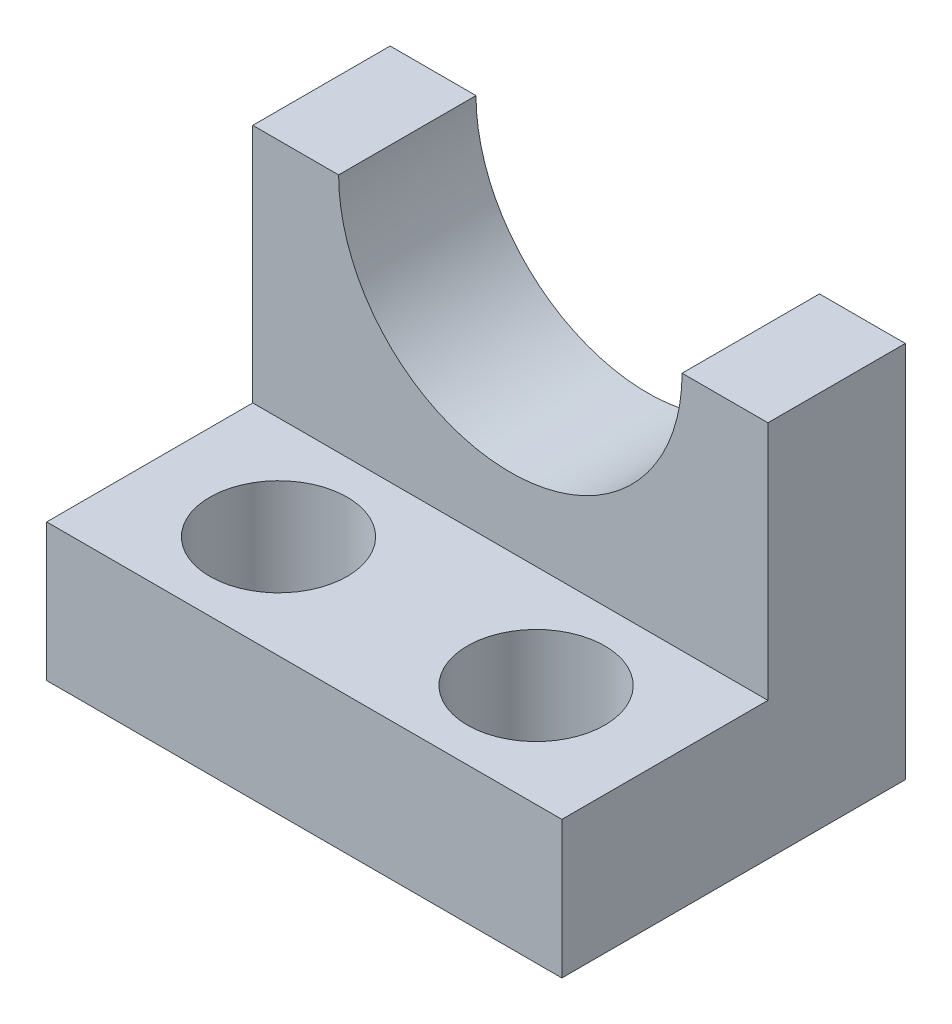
ISO-10303-21;
HEADER;
FILE_DESCRIPTION(('STEP AP214'),'2;1');
FILE_NAME('part.step','',(''),(''),'','','');
FILE_SCHEMA(('AUTOMOTIVE_DESIGN { 1 0 10303 214 1 1 1 1 }'));
ENDSEC;
DATA;
#1=APPLICATION_CONTEXT('core data for automotive mechanical design processes');
#2=APPLICATION_PROTOCOL_DEFINITION('international standard','automotive_design',2000,#1);
#3=PRODUCT_CONTEXT('',#1,'mechanical');
#4=PRODUCT('Part','Part','',(#3));
#5=PRODUCT_RELATED_PRODUCT_CATEGORY('part','',(#4));
#6=PRODUCT_DEFINITION_FORMATION('','',#4);
#7=PRODUCT_DEFINITION_CONTEXT('part definition',#1,'design');
#8=PRODUCT_DEFINITION('design','',#6,#7);
#9=PRODUCT_DEFINITION_SHAPE('','',#8);
#10=(LENGTH_UNIT() NAMED_UNIT(*) SI_UNIT(.MILLI.,.METRE.));
#11=(NAMED_UNIT(*) PLANE_ANGLE_UNIT() SI_UNIT($,.RADIAN.));
#12=(NAMED_UNIT(*) SI_UNIT($,.STERADIAN.) SOLID_ANGLE_UNIT());
#13=UNCERTAINTY_MEASURE_WITH_UNIT(LENGTH_MEASURE(1.E-05),#10,'distance_accuracy_value','');
#14=(GEOMETRIC_REPRESENTATION_CONTEXT(3) GLOBAL_UNCERTAINTY_ASSIGNED_CONTEXT((#13)) GLOBAL_UNIT_ASSIGNED_CONTEXT((#10,
#11,#12)) REPRESENTATION_CONTEXT('',''));
#15=CARTESIAN_POINT('',(0.,0.,0.));
#16=DIRECTION('',(0.,0.,1.));
#17=DIRECTION('',(1.,0.,0.));
#18=AXIS2_PLACEMENT_3D('',#15,#16,#17);
#19=CARTESIAN_POINT('',(0.,22.,-12.));
#20=DIRECTION('',(0.,1.,0.));
#21=DIRECTION('',(0.,0.,1.));
#22=AXIS2_PLACEMENT_3D('',#19,#20,#21);
#23=PLANE('',#22);
#24=DIRECTION('',(0.,0.,1.));
#25=VECTOR('',#24,1.);
#26=CARTESIAN_POINT('',(5.,22.,-20.));
#27=LINE('',#26,#25);
#28=CARTESIAN_POINT('',(5.,22.,-20.));
#29=VERTEX_POINT('',#28);
#30=CARTESIAN_POINT('',(5.,22.,-12.));
#31=VERTEX_POINT('',#30);
#32=EDGE_CURVE('E11',#29,#31,#27,.T.);
#33=ORIENTED_EDGE('',*,*,#32,.F.);
#34=DIRECTION('',(-1.,0.,0.));
#35=VECTOR('',#34,1.);
#36=CARTESIAN_POINT('',(0.,22.,-20.));
#37=LINE('',#36,#35);
#38=CARTESIAN_POINT('',(0.,22.,-20.));
#39=VERTEX_POINT('',#38);
#40=EDGE_CURVE('E114',#29,#39,#37,.T.);
#41=ORIENTED_EDGE('',*,*,#40,.T.);
#42=DIRECTION('',(0.,0.,1.));
#43=VECTOR('',#42,1.);
#44=CARTESIAN_POINT('',(0.,22.,-20.));
#45=LINE('',#44,#43);
#46=CARTESIAN_POINT('',(0.,22.,-12.));
#47=VERTEX_POINT('',#46);
#48=EDGE_CURVE('E109',#39,#47,#45,.T.);
#49=ORIENTED_EDGE('',*,*,#48,.T.);
#50=DIRECTION('',(1.,0.,0.));
#51=VECTOR('',#50,1.);
#52=CARTESIAN_POINT('',(0.,22.,-12.));
#53=LINE('',#52,#51);
#54=EDGE_CURVE('E103',#47,#31,#53,.T.);
#55=ORIENTED_EDGE('',*,*,#54,.T.);
#56=EDGE_LOOP('',(#33,#41,#49,#55));
#57=FACE_BOUND('',#56,.T.);
#58=ADVANCED_FACE('F31',(#57),#23,.T.);
#59=CARTESIAN_POINT('',(0.,8.,-20.));
#60=DIRECTION('',(0.,-1.,0.));
#61=DIRECTION('',(0.,0.,-1.));
#62=AXIS2_PLACEMENT_3D('',#59,#60,#61);
#63=PLANE('',#62);
#64=CARTESIAN_POINT('',(22.5,8.,-6.));
#65=DIRECTION('',(0.,1.,0.));
#66=DIRECTION('',(0.,0.,1.));
#67=AXIS2_PLACEMENT_3D('',#64,#65,#66);
#68=CIRCLE('',#67,4.);
#69=CARTESIAN_POINT('',(22.5,8.,-2.));
#70=VERTEX_POINT('',#69);
#71=EDGE_CURVE('E185',#70,#70,#68,.T.);
#72=ORIENTED_EDGE('',*,*,#71,.F.);
#73=EDGE_LOOP('',(#72));
#74=FACE_BOUND('',#73,.T.);
#75=CARTESIAN_POINT('',(7.5,8.,-6.));
#76=DIRECTION('',(0.,1.,0.));
#77=DIRECTION('',(0.,0.,1.));
#78=AXIS2_PLACEMENT_3D('',#75,#76,#77);
#79=CIRCLE('',#78,4.);
#80=CARTESIAN_POINT('',(7.5,8.,-2.));
#81=VERTEX_POINT('',#80);
#82=EDGE_CURVE('E280',#81,#81,#79,.T.);
#83=ORIENTED_EDGE('',*,*,#82,.F.);
#84=EDGE_LOOP('',(#83));
#85=FACE_BOUND('',#84,.T.);
#86=DIRECTION('',(1.,0.,0.));
#87=VECTOR('',#86,1.);
#88=CARTESIAN_POINT('',(0.,8.,-12.));
#89=LINE('',#88,#87);
#90=CARTESIAN_POINT('',(0.,8.,-12.));
#91=VERTEX_POINT('',#90);
#92=CARTESIAN_POINT('',(30.,8.,-12.));
#93=VERTEX_POINT('',#92);
#94=EDGE_CURVE('E53',#91,#93,#89,.T.);
#95=ORIENTED_EDGE('',*,*,#94,.F.);
#96=DIRECTION('',(0.,0.,1.));
#97=VECTOR('',#96,1.);
#98=CARTESIAN_POINT('',(0.,8.,0.));
#99=LINE('',#98,#97);
#100=CARTESIAN_POINT('',(0.,8.,0.));
#101=VERTEX_POINT('',#100);
#102=EDGE_CURVE('E154',#91,#101,#99,.T.);
#103=ORIENTED_EDGE('',*,*,#102,.T.);
#104=DIRECTION('',(1.,0.,0.));
#105=VECTOR('',#104,1.);
#106=CARTESIAN_POINT('',(0.,8.,0.));
#107=LINE('',#106,#105);
#108=CARTESIAN_POINT('',(30.,8.,0.));
#109=VERTEX_POINT('',#108);
#110=EDGE_CURVE('E155',#101,#109,#107,.T.);
#111=ORIENTED_EDGE('',*,*,#110,.T.);
#112=DIRECTION('',(0.,0.,-1.));
#113=VECTOR('',#112,1.);
#114=CARTESIAN_POINT('',(30.,8.,0.));
#115=LINE('',#114,#113);
#116=EDGE_CURVE('E131',#109,#93,#115,.T.);
#117=ORIENTED_EDGE('',*,*,#116,.T.);
#118=EDGE_LOOP('',(#95,#103,#111,#117));
#119=FACE_BOUND('',#118,.T.);
#120=ADVANCED_FACE('F184',(#74,#85,#119),#63,.F.);
#121=CARTESIAN_POINT('',(0.,8.,0.));
#122=DIRECTION('',(1.,0.,0.));
#123=DIRECTION('',(0.,0.,-1.));
#124=AXIS2_PLACEMENT_3D('',#121,#122,#123);
#125=PLANE('',#124);
#126=DIRECTION('',(0.,0.,1.));
#127=VECTOR('',#126,1.);
#128=CARTESIAN_POINT('',(0.,0.,0.));
#129=LINE('',#128,#127);
#130=CARTESIAN_POINT('',(0.,0.,-20.));
#131=VERTEX_POINT('',#130);
#132=CARTESIAN_POINT('',(0.,0.,0.));
#133=VERTEX_POINT('',#132);
#134=EDGE_CURVE('E140',#131,#133,#129,.T.);
#135=ORIENTED_EDGE('',*,*,#134,.T.);
#136=DIRECTION('',(0.,-1.,0.));
#137=VECTOR('',#136,1.);
#138=CARTESIAN_POINT('',(0.,8.,0.));
#139=LINE('',#138,#137);
#140=EDGE_CURVE('E142',#101,#133,#139,.T.);
#141=ORIENTED_EDGE('',*,*,#140,.F.);
#142=ORIENTED_EDGE('',*,*,#102,.F.);
#143=DIRECTION('',(0.,-1.,0.));
#144=VECTOR('',#143,1.);
#145=CARTESIAN_POINT('',(0.,22.,-12.));
#146=LINE('',#145,#144);
#147=EDGE_CURVE('E136',#47,#91,#146,.T.);
#148=ORIENTED_EDGE('',*,*,#147,.F.);
#149=ORIENTED_EDGE('',*,*,#48,.F.);
#150=DIRECTION('',(0.,-1.,0.));
#151=VECTOR('',#150,1.);
#152=CARTESIAN_POINT('',(0.,8.,-20.));
#153=LINE('',#152,#151);
#154=EDGE_CURVE('E168',#39,#131,#153,.T.);
#155=ORIENTED_EDGE('',*,*,#154,.T.);
#156=EDGE_LOOP('',(#135,#141,#142,#148,#149,#155));
#157=FACE_BOUND('',#156,.T.);
#158=ADVANCED_FACE('F33',(#157),#125,.F.);
#159=CARTESIAN_POINT('',(0.,8.,0.));
#160=DIRECTION('',(0.,0.,-1.));
#161=DIRECTION('',(-1.,0.,0.));
#162=AXIS2_PLACEMENT_3D('',#159,#160,#161);
#163=PLANE('',#162);
#164=DIRECTION('',(1.,0.,0.));
#165=VECTOR('',#164,1.);
#166=CARTESIAN_POINT('',(0.,0.,0.));
#167=LINE('',#166,#165);
#168=CARTESIAN_POINT('',(30.,0.,0.));
#169=VERTEX_POINT('',#168);
#170=EDGE_CURVE('E164',#133,#169,#167,.T.);
#171=ORIENTED_EDGE('',*,*,#170,.T.);
#172=DIRECTION('',(0.,-1.,0.));
#173=VECTOR('',#172,1.);
#174=CARTESIAN_POINT('',(30.,8.,0.));
#175=LINE('',#174,#173);
#176=EDGE_CURVE('E144',#109,#169,#175,.T.);
#177=ORIENTED_EDGE('',*,*,#176,.F.);
#178=ORIENTED_EDGE('',*,*,#110,.F.);
#179=ORIENTED_EDGE('',*,*,#140,.T.);
#180=EDGE_LOOP('',(#171,#177,#178,#179));
#181=FACE_BOUND('',#180,.T.);
#182=ADVANCED_FACE('F181',(#181),#163,.F.);
#183=CARTESIAN_POINT('',(30.,8.,0.));
#184=DIRECTION('',(-1.,0.,0.));
#185=DIRECTION('',(0.,0.,1.));
#186=AXIS2_PLACEMENT_3D('',#183,#184,#185);
#187=PLANE('',#186);
#188=DIRECTION('',(0.,0.,-1.));
#189=VECTOR('',#188,1.);
#190=CARTESIAN_POINT('',(30.,0.,0.));
#191=LINE('',#190,#189);
#192=CARTESIAN_POINT('',(30.,0.,-20.));
#193=VERTEX_POINT('',#192);
#194=EDGE_CURVE('E157',#169,#193,#191,.T.);
#195=ORIENTED_EDGE('',*,*,#194,.T.);
#196=DIRECTION('',(0.,-1.,0.));
#197=VECTOR('',#196,1.);
#198=CARTESIAN_POINT('',(30.,8.,-20.));
#199=LINE('',#198,#197);
#200=CARTESIAN_POINT('',(30.,22.,-20.));
#201=VERTEX_POINT('',#200);
#202=EDGE_CURVE('E151',#201,#193,#199,.T.);
#203=ORIENTED_EDGE('',*,*,#202,.F.);
#204=DIRECTION('',(0.,0.,-1.));
#205=VECTOR('',#204,1.);
#206=CARTESIAN_POINT('',(30.,22.,-20.));
#207=LINE('',#206,#205);
#208=CARTESIAN_POINT('',(30.,22.,-12.));
#209=VERTEX_POINT('',#208);
#210=EDGE_CURVE('E111',#209,#201,#207,.T.);
#211=ORIENTED_EDGE('',*,*,#210,.F.);
#212=DIRECTION('',(0.,-1.,0.));
#213=VECTOR('',#212,1.);
#214=CARTESIAN_POINT('',(30.,22.,-12.));
#215=LINE('',#214,#213);
#216=EDGE_CURVE('E122',#209,#93,#215,.T.);
#217=ORIENTED_EDGE('',*,*,#216,.T.);
#218=ORIENTED_EDGE('',*,*,#116,.F.);
#219=ORIENTED_EDGE('',*,*,#176,.T.);
#220=EDGE_LOOP('',(#195,#203,#211,#217,#218,#219));
#221=FACE_BOUND('',#220,.T.);
#222=ADVANCED_FACE('F183',(#221),#187,.F.);
#223=CARTESIAN_POINT('',(0.,8.,-20.));
#224=DIRECTION('',(0.,0.,1.));
#225=DIRECTION('',(1.,0.,0.));
#226=AXIS2_PLACEMENT_3D('',#223,#224,#225);
#227=PLANE('',#226);
#228=ORIENTED_EDGE('',*,*,#40,.F.);
#229=CARTESIAN_POINT('',(15.,22.,-20.));
#230=DIRECTION('',(0.,0.,1.));
#231=DIRECTION('',(1.,0.,0.));
#232=AXIS2_PLACEMENT_3D('',#229,#230,#231);
#233=CIRCLE('',#232,10.);
#234=CARTESIAN_POINT('',(25.,22.,-20.));
#235=VERTEX_POINT('',#234);
#236=EDGE_CURVE('E95',#29,#235,#233,.T.);
#237=ORIENTED_EDGE('',*,*,#236,.T.);
#238=EDGE_CURVE('E119',#201,#235,#37,.T.);
#239=ORIENTED_EDGE('',*,*,#238,.F.);
#240=ORIENTED_EDGE('',*,*,#202,.T.);
#241=DIRECTION('',(-1.,0.,0.));
#242=VECTOR('',#241,1.);
#243=CARTESIAN_POINT('',(0.,0.,-20.));
#244=LINE('',#243,#242);
#245=EDGE_CURVE('E156',#193,#131,#244,.T.);
#246=ORIENTED_EDGE('',*,*,#245,.T.);
#247=ORIENTED_EDGE('',*,*,#154,.F.);
#248=EDGE_LOOP('',(#228,#237,#239,#240,#246,#247));
#249=FACE_BOUND('',#248,.T.);
#250=ADVANCED_FACE('F170',(#249),#227,.F.);
#251=CARTESIAN_POINT('',(0.,0.,-20.));
#252=DIRECTION('',(0.,-1.,0.));
#253=DIRECTION('',(0.,0.,-1.));
#254=AXIS2_PLACEMENT_3D('',#251,#252,#253);
#255=PLANE('',#254);
#256=CARTESIAN_POINT('',(22.5,0.,-6.));
#257=DIRECTION('',(0.,1.,0.));
#258=DIRECTION('',(0.,0.,1.));
#259=AXIS2_PLACEMENT_3D('',#256,#257,#258);
#260=CIRCLE('',#259,4.);
#261=CARTESIAN_POINT('',(22.5,0.,-2.));
#262=VERTEX_POINT('',#261);
#263=EDGE_CURVE('E277',#262,#262,#260,.T.);
#264=ORIENTED_EDGE('',*,*,#263,.T.);
#265=EDGE_LOOP('',(#264));
#266=FACE_BOUND('',#265,.T.);
#267=CARTESIAN_POINT('',(7.5,0.,-6.));
#268=DIRECTION('',(0.,1.,0.));
#269=DIRECTION('',(0.,0.,1.));
#270=AXIS2_PLACEMENT_3D('',#267,#268,#269);
#271=CIRCLE('',#270,4.);
#272=CARTESIAN_POINT('',(7.5,0.,-2.));
#273=VERTEX_POINT('',#272);
#274=EDGE_CURVE('E130',#273,#273,#271,.T.);
#275=ORIENTED_EDGE('',*,*,#274,.T.);
#276=EDGE_LOOP('',(#275));
#277=FACE_BOUND('',#276,.T.);
#278=ORIENTED_EDGE('',*,*,#134,.F.);
#279=ORIENTED_EDGE('',*,*,#245,.F.);
#280=ORIENTED_EDGE('',*,*,#194,.F.);
#281=ORIENTED_EDGE('',*,*,#170,.F.);
#282=EDGE_LOOP('',(#278,#279,#280,#281));
#283=FACE_BOUND('',#282,.T.);
#284=ADVANCED_FACE('F176',(#266,#277,#283),#255,.T.);
#285=CARTESIAN_POINT('',(0.,22.,-12.));
#286=DIRECTION('',(0.,0.,-1.));
#287=DIRECTION('',(-1.,0.,0.));
#288=AXIS2_PLACEMENT_3D('',#285,#286,#287);
#289=PLANE('',#288);
#290=CARTESIAN_POINT('',(25.,22.,-12.));
#291=VERTEX_POINT('',#290);
#292=EDGE_CURVE('E106',#291,#209,#53,.T.);
#293=ORIENTED_EDGE('',*,*,#292,.F.);
#294=CARTESIAN_POINT('',(15.,22.,-12.));
#295=DIRECTION('',(0.,0.,1.));
#296=DIRECTION('',(1.,0.,0.));
#297=AXIS2_PLACEMENT_3D('',#294,#295,#296);
#298=CIRCLE('',#297,10.);
#299=EDGE_CURVE('E45',#31,#291,#298,.T.);
#300=ORIENTED_EDGE('',*,*,#299,.F.);
#301=ORIENTED_EDGE('',*,*,#54,.F.);
#302=ORIENTED_EDGE('',*,*,#147,.T.);
#303=ORIENTED_EDGE('',*,*,#94,.T.);
#304=ORIENTED_EDGE('',*,*,#216,.F.);
#305=EDGE_LOOP('',(#293,#300,#301,#302,#303,#304));
#306=FACE_BOUND('',#305,.T.);
#307=ADVANCED_FACE('F101',(#306),#289,.F.);
#308=DIRECTION('',(0.,0.,1.));
#309=VECTOR('',#308,1.);
#310=CARTESIAN_POINT('',(25.,22.,-20.));
#311=LINE('',#310,#309);
#312=EDGE_CURVE('E39',#291,#235,#311,.F.);
#313=ORIENTED_EDGE('',*,*,#312,.F.);
#314=ORIENTED_EDGE('',*,*,#292,.T.);
#315=ORIENTED_EDGE('',*,*,#210,.T.);
#316=ORIENTED_EDGE('',*,*,#238,.T.);
#317=EDGE_LOOP('',(#313,#314,#315,#316));
#318=FACE_BOUND('',#317,.T.);
#319=ADVANCED_FACE('F188',(#318),#23,.T.);
#320=CARTESIAN_POINT('',(7.5,0.,-6.));
#321=DIRECTION('',(0.,1.,0.));
#322=DIRECTION('',(0.,0.,1.));
#323=AXIS2_PLACEMENT_3D('',#320,#321,#322);
#324=CYLINDRICAL_SURFACE('',#323,4.);
#325=ORIENTED_EDGE('',*,*,#274,.F.);
#326=EDGE_LOOP('',(#325));
#327=FACE_BOUND('',#326,.T.);
#328=ORIENTED_EDGE('',*,*,#82,.T.);
#329=EDGE_LOOP('',(#328));
#330=FACE_BOUND('',#329,.T.);
#331=ADVANCED_FACE('F190',(#327,#330),#324,.F.);
#332=CARTESIAN_POINT('',(22.5,0.,-6.));
#333=DIRECTION('',(0.,1.,0.));
#334=DIRECTION('',(0.,0.,1.));
#335=AXIS2_PLACEMENT_3D('',#332,#333,#334);
#336=CYLINDRICAL_SURFACE('',#335,4.);
#337=ORIENTED_EDGE('',*,*,#263,.F.);
#338=EDGE_LOOP('',(#337));
#339=FACE_BOUND('',#338,.T.);
#340=ORIENTED_EDGE('',*,*,#71,.T.);
#341=EDGE_LOOP('',(#340));
#342=FACE_BOUND('',#341,.T.);
#343=ADVANCED_FACE('F196',(#339,#342),#336,.F.);
#344=CARTESIAN_POINT('',(15.,22.,-20.));
#345=DIRECTION('',(0.,0.,1.));
#346=DIRECTION('',(1.,0.,0.));
#347=AXIS2_PLACEMENT_3D('',#344,#345,#346);
#348=CYLINDRICAL_SURFACE('',#347,10.);
#349=ORIENTED_EDGE('',*,*,#32,.T.);
#350=ORIENTED_EDGE('',*,*,#299,.T.);
#351=ORIENTED_EDGE('',*,*,#312,.T.);
#352=ORIENTED_EDGE('',*,*,#236,.F.);
#353=EDGE_LOOP('',(#349,#350,#351,#352));
#354=FACE_BOUND('',#353,.T.);
#355=ADVANCED_FACE('F93',(#354),#348,.F.);
#356=CLOSED_SHELL('',(#58,#120,#158,#182,#222,#250,#284,#307,#319,#331,#343,#355));
#357=MANIFOLD_SOLID_BREP('B2',#356);
#358=ADVANCED_BREP_SHAPE_REPRESENTATION('',(#18,#357),#14);
#359=SHAPE_DEFINITION_REPRESENTATION(#9,#358);
ENDSEC;
END-ISO-10303-21;
